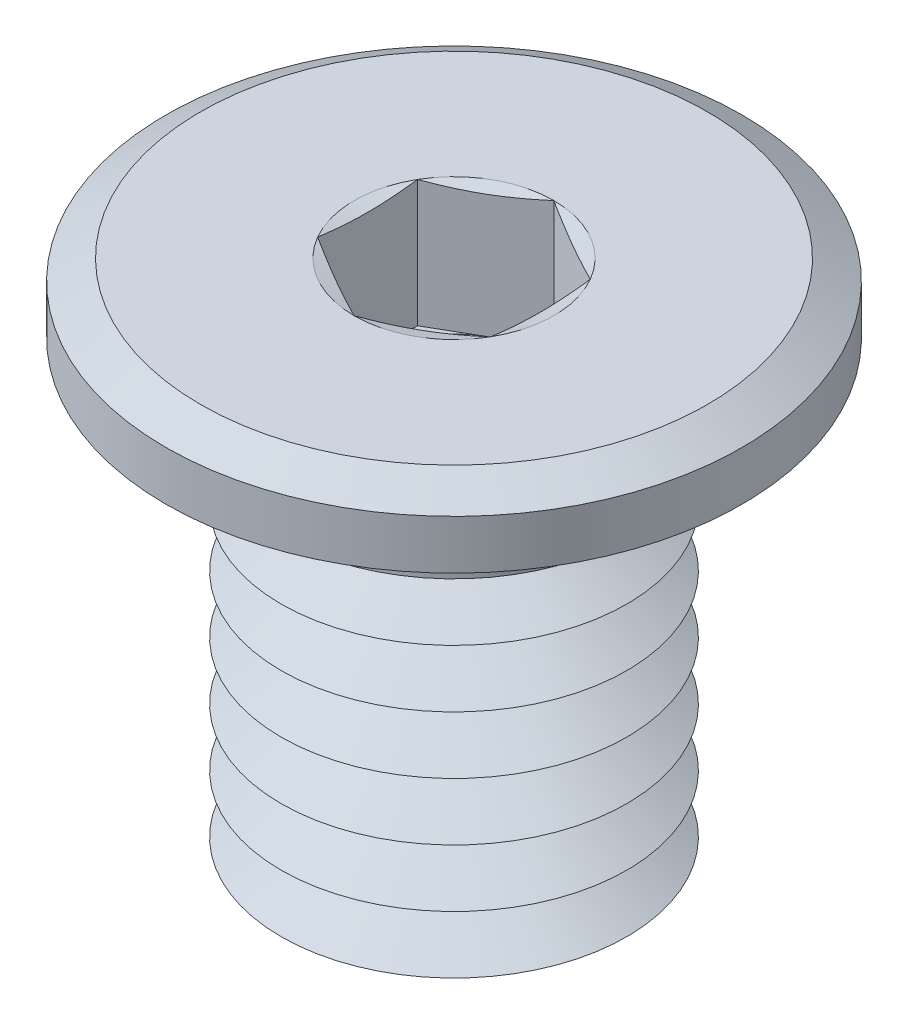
from build123d import *

# Parameters (mm, degrees)
SKETCH1_R           = 5
BOSS_EXTRUDE1_DEPTH = 1.2
SKETCH2_R           = 3
BOSS_EXTRUDE2_DEPTH = 8
LPATTERN1_COUNT     = 7
LPATTERN1_PITCH     = 1
FILLET1_R           = 0.25
CHAMFER2_SIZE       = 0.6
CHAMFER2_SIZE2      = 0.346410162
CUT_EXTRUDE1_DEPTH  = 2.2


with BuildPart() as part:
    # Sketch1 → Boss-Extrude1 (new body)
    with BuildSketch(Plane(origin=(0, 0, 0), x_dir=(1, 0, 0), z_dir=(0, 1, 0))):
        with Locations(Location((0, 0, 0), (0, 0, 270))):
            Circle(SKETCH1_R)
    extrude(amount=-BOSS_EXTRUDE1_DEPTH)

    # Sketch2 → Boss-Extrude2 (add)
    with BuildSketch(Plane.XZ.offset(1.2)):
        with Locations(Location((0, 0, 0), (0, 0, 270))):
            Circle(SKETCH2_R)
    extrude(amount=BOSS_EXTRUDE2_DEPTH)

    # Sketch5 → Cut-Revolve1 (revolve, cut)
    with BuildSketch(Plane(origin=(0, 0, 0), x_dir=(0, 0, -1), z_dir=(1, 0, 0))):
        Polygon((-3, -9.7), (-2.133974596, -9.2), (-3, -8.7), align=None)
    cut_revolve1 = revolve(axis=Axis((0, 0.990593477, 0), (0, -1, 0)), mode=Mode.SUBTRACT)

    # LPattern1: Cut-Revolve1 ×7
    with Locations(*[(0, i * LPATTERN1_PITCH, 0) for i in range(1, LPATTERN1_COUNT)]):
        add(cut_revolve1, mode=Mode.SUBTRACT)

    # Fillet1
    fillet1_edges = [part.edges().sort_by_distance(p)[0] for p in [
        (0, -1.2, 3),
    ]]
    fillet(fillet1_edges, radius=FILLET1_R)

    # Chamfer2
    chamfer2_edges = [part.edges().sort_by_distance(p)[0] for p in [
        (0, 0, -5),
    ]]
    chamfer2_side = [part.faces().sort_by_distance(p)[0] for p in [
        (0, 0, 0),
    ]]
    chamfer(chamfer2_edges, length=CHAMFER2_SIZE, length2=CHAMFER2_SIZE2, reference=chamfer2_side[0])

    # Sketch6 → Cut-Extrude1 (cut)
    with BuildSketch(Plane(origin=(0, 0, 0), x_dir=(1, 0, 0), z_dir=(0, 1, 0))):
        Polygon((0, 1.732050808), (-1.5, 0.866025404), (-1.5, -0.866025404), (0, -1.732050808), (1.5, -0.866025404), (1.5, 0.866025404), align=None)
    extrude(amount=-CUT_EXTRUDE1_DEPTH, mode=Mode.SUBTRACT)

    # Cut-Extrude2 cone 1 section (on through the dimple's axis) → Cut-Extrude2 (revolve, cut)
    with BuildSketch(Plane(origin=(0, -2.2, 0), x_dir=(0, 0, 1), z_dir=(1, 0, 0))):
        Polygon((0, 0), (1.5, 0), (0, 0.866025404), align=None)
    revolve(axis=Axis((0, -2.2, 0), (0, -1, 0)), mode=Mode.SUBTRACT)

    # Cut-Extrude3 cone 1 section (on through the dimple's axis) → Cut-Extrude3 (revolve, cut)
    with BuildSketch(Plane(origin=(0, 0, 0), x_dir=(0, 0, 1), z_dir=(1, 0, 0))):
        Polygon((0, 0), (1.732050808, 0), (0, 0.464101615), align=None)
    revolve(axis=Axis((0, 0, 0), (0, -1, 0)), mode=Mode.SUBTRACT)


solid = part.part
